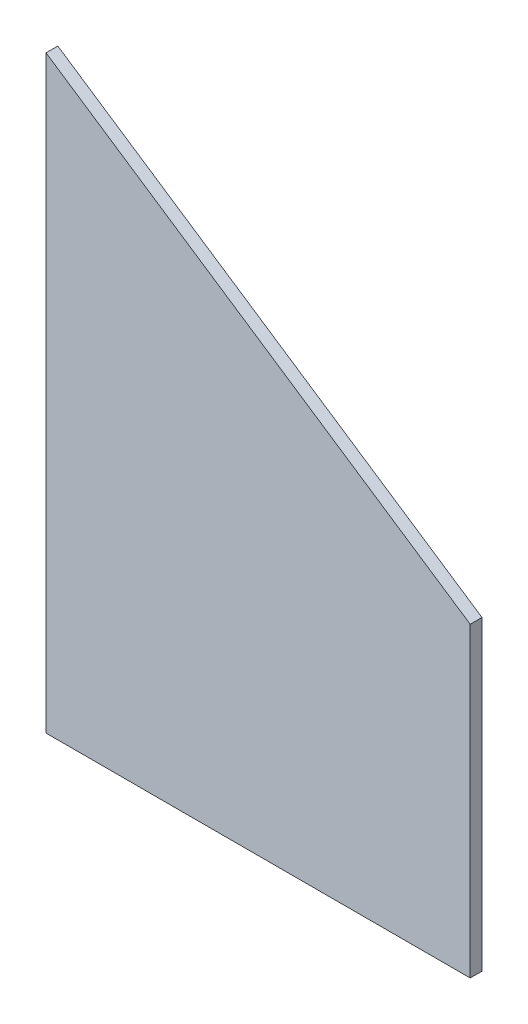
from build123d import *


with BuildPart() as part:
    # Sketch1 → Tapered_plywood_panel section 0
    with BuildSketch(Plane.YZ):
        with BuildLine():
            Line((-158.75, -158.75), (158.75, -158.75))
            Line((158.75, -158.75), (158.75, -152.4))
            Line((158.75, -152.4), (-158.75, -152.4))
            Line((-158.75, -152.4), (-158.75, -158.75))
        make_face()
    # Sketch2 → Tapered_plywood_panel section 1
    with BuildSketch(Plane.YZ.offset(304.8)):
        with BuildLine():
            Line((-82.55, -82.55), (82.55, -82.55))
            Line((82.55, -82.55), (82.55, -76.2))
            Line((82.55, -76.2), (-82.55, -76.2))
            Line((-82.55, -76.2), (-82.55, -82.55))
        make_face()
    loft()


solid = part.part
